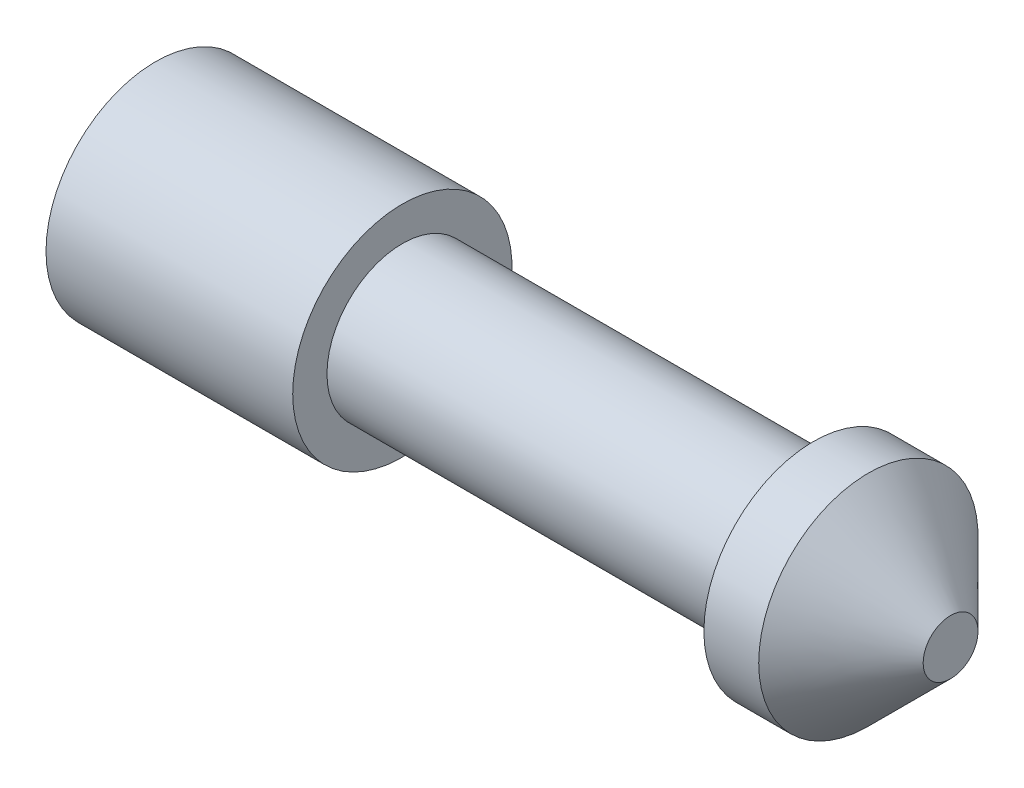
ISO-10303-21;
HEADER;
FILE_DESCRIPTION(('STEP AP214'),'2;1');
FILE_NAME('part.step','',(''),(''),'','','');
FILE_SCHEMA(('AUTOMOTIVE_DESIGN { 1 0 10303 214 1 1 1 1 }'));
ENDSEC;
DATA;
#1=APPLICATION_CONTEXT('core data for automotive mechanical design processes');
#2=APPLICATION_PROTOCOL_DEFINITION('international standard','automotive_design',2000,#1);
#3=PRODUCT_CONTEXT('',#1,'mechanical');
#4=PRODUCT('Part','Part','',(#3));
#5=PRODUCT_RELATED_PRODUCT_CATEGORY('part','',(#4));
#6=PRODUCT_DEFINITION_FORMATION('','',#4);
#7=PRODUCT_DEFINITION_CONTEXT('part definition',#1,'design');
#8=PRODUCT_DEFINITION('design','',#6,#7);
#9=PRODUCT_DEFINITION_SHAPE('','',#8);
#10=(LENGTH_UNIT() NAMED_UNIT(*) SI_UNIT(.MILLI.,.METRE.));
#11=(NAMED_UNIT(*) PLANE_ANGLE_UNIT() SI_UNIT($,.RADIAN.));
#12=(NAMED_UNIT(*) SI_UNIT($,.STERADIAN.) SOLID_ANGLE_UNIT());
#13=UNCERTAINTY_MEASURE_WITH_UNIT(LENGTH_MEASURE(1.E-05),#10,'distance_accuracy_value','');
#14=(GEOMETRIC_REPRESENTATION_CONTEXT(3) GLOBAL_UNCERTAINTY_ASSIGNED_CONTEXT((#13)) GLOBAL_UNIT_ASSIGNED_CONTEXT((#10,
#11,#12)) REPRESENTATION_CONTEXT('',''));
#15=CARTESIAN_POINT('',(0.,0.,0.));
#16=DIRECTION('',(0.,0.,1.));
#17=DIRECTION('',(1.,0.,0.));
#18=AXIS2_PLACEMENT_3D('',#15,#16,#17);
#19=CARTESIAN_POINT('',(0.,0.,0.));
#20=DIRECTION('',(-1.,0.,0.));
#21=DIRECTION('',(0.,0.,1.));
#22=AXIS2_PLACEMENT_3D('',#19,#20,#21);
#23=CYLINDRICAL_SURFACE('',#22,4.);
#24=CARTESIAN_POINT('',(0.,0.,0.));
#25=DIRECTION('',(-1.,0.,0.));
#26=DIRECTION('',(0.,0.,1.));
#27=AXIS2_PLACEMENT_3D('',#24,#25,#26);
#28=CIRCLE('',#27,4.);
#29=CARTESIAN_POINT('',(0.,0.,4.));
#30=VERTEX_POINT('',#29);
#31=EDGE_CURVE('E10',#30,#30,#28,.T.);
#32=ORIENTED_EDGE('',*,*,#31,.F.);
#33=EDGE_LOOP('',(#32));
#34=FACE_BOUND('',#33,.T.);
#35=CARTESIAN_POINT('',(9.,0.,0.));
#36=DIRECTION('',(-1.,0.,0.));
#37=DIRECTION('',(0.,0.,1.));
#38=AXIS2_PLACEMENT_3D('',#35,#36,#37);
#39=CIRCLE('',#38,4.);
#40=CARTESIAN_POINT('',(9.,0.,4.));
#41=VERTEX_POINT('',#40);
#42=EDGE_CURVE('E54',#41,#41,#39,.T.);
#43=ORIENTED_EDGE('',*,*,#42,.T.);
#44=EDGE_LOOP('',(#43));
#45=FACE_BOUND('',#44,.T.);
#46=ADVANCED_FACE('F29',(#34,#45),#23,.T.);
#47=CARTESIAN_POINT('',(0.,0.,-4.));
#48=DIRECTION('',(1.,0.,0.));
#49=DIRECTION('',(0.,0.,-1.));
#50=AXIS2_PLACEMENT_3D('',#47,#48,#49);
#51=PLANE('',#50);
#52=ORIENTED_EDGE('',*,*,#31,.T.);
#53=EDGE_LOOP('',(#52));
#54=FACE_BOUND('',#53,.T.);
#55=ADVANCED_FACE('F90',(#54),#51,.F.);
#56=CARTESIAN_POINT('',(29.,0.,0.));
#57=DIRECTION('',(-1.,0.,0.));
#58=DIRECTION('',(0.,0.,1.));
#59=AXIS2_PLACEMENT_3D('',#56,#57,#58);
#60=PLANE('',#59);
#61=CARTESIAN_POINT('',(29.,0.,0.));
#62=DIRECTION('',(-1.,0.,0.));
#63=DIRECTION('',(0.,0.,1.));
#64=AXIS2_PLACEMENT_3D('',#61,#62,#63);
#65=CIRCLE('',#64,1.00000000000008);
#66=CARTESIAN_POINT('',(29.,0.,1.00000000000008));
#67=VERTEX_POINT('',#66);
#68=EDGE_CURVE('E35',#67,#67,#65,.T.);
#69=ORIENTED_EDGE('',*,*,#68,.F.);
#70=EDGE_LOOP('',(#69));
#71=FACE_BOUND('',#70,.T.);
#72=ADVANCED_FACE('F85',(#71),#60,.F.);
#73=CARTESIAN_POINT('',(29.,0.,0.));
#74=DIRECTION('',(-1.,0.,0.));
#75=DIRECTION('',(0.,0.,1.));
#76=AXIS2_PLACEMENT_3D('',#73,#74,#75);
#77=CONICAL_SURFACE('',#76,1.00000000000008,0.785398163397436);
#78=CARTESIAN_POINT('',(26.,0.,0.));
#79=DIRECTION('',(-1.,0.,0.));
#80=DIRECTION('',(0.,0.,1.));
#81=AXIS2_PLACEMENT_3D('',#78,#79,#80);
#82=CIRCLE('',#81,4.);
#83=CARTESIAN_POINT('',(26.,0.,4.));
#84=VERTEX_POINT('',#83);
#85=EDGE_CURVE('E39',#84,#84,#82,.T.);
#86=CARTESIAN_POINT('',(26.,0.,4.));
#87=CARTESIAN_POINT('',(26.03125,0.,3.96875));
#88=CARTESIAN_POINT('',(26.0625,0.,3.9375));
#89=CARTESIAN_POINT('',(26.125,0.,3.875));
#90=CARTESIAN_POINT('',(26.15625,0.,3.84375));
#91=CARTESIAN_POINT('',(26.21875,0.,3.78125));
#92=CARTESIAN_POINT('',(26.25,0.,3.75));
#93=CARTESIAN_POINT('',(26.3125,0.,3.68750000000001));
#94=CARTESIAN_POINT('',(26.34375,0.,3.65625000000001));
#95=CARTESIAN_POINT('',(26.40625,0.,3.59375000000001));
#96=CARTESIAN_POINT('',(26.4375,0.,3.56250000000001));
#97=CARTESIAN_POINT('',(26.5,0.,3.50000000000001));
#98=CARTESIAN_POINT('',(26.53125,0.,3.46875000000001));
#99=CARTESIAN_POINT('',(26.59375,0.,3.40625000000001));
#100=CARTESIAN_POINT('',(26.625,0.,3.37500000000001));
#101=CARTESIAN_POINT('',(26.6875,0.,3.31250000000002));
#102=CARTESIAN_POINT('',(26.71875,0.,3.28125000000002));
#103=CARTESIAN_POINT('',(26.78125,0.,3.21875000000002));
#104=CARTESIAN_POINT('',(26.8125,0.,3.18750000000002));
#105=CARTESIAN_POINT('',(26.875,0.,3.12500000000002));
#106=CARTESIAN_POINT('',(26.90625,0.,3.09375000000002));
#107=CARTESIAN_POINT('',(26.96875,0.,3.03125000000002));
#108=CARTESIAN_POINT('',(27.,0.,3.00000000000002));
#109=CARTESIAN_POINT('',(27.0625,0.,2.93750000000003));
#110=CARTESIAN_POINT('',(27.09375,0.,2.90625000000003));
#111=CARTESIAN_POINT('',(27.15625,0.,2.84375000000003));
#112=CARTESIAN_POINT('',(27.1875,0.,2.81250000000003));
#113=CARTESIAN_POINT('',(27.25,0.,2.75000000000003));
#114=CARTESIAN_POINT('',(27.28125,0.,2.71875000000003));
#115=CARTESIAN_POINT('',(27.34375,0.,2.65625000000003));
#116=CARTESIAN_POINT('',(27.375,0.,2.62500000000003));
#117=CARTESIAN_POINT('',(27.4375,0.,2.56250000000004));
#118=CARTESIAN_POINT('',(27.46875,0.,2.53125000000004));
#119=CARTESIAN_POINT('',(27.53125,0.,2.46875000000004));
#120=CARTESIAN_POINT('',(27.5625,0.,2.43750000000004));
#121=CARTESIAN_POINT('',(27.625,0.,2.37500000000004));
#122=CARTESIAN_POINT('',(27.65625,0.,2.34375000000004));
#123=CARTESIAN_POINT('',(27.71875,0.,2.28125000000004));
#124=CARTESIAN_POINT('',(27.75,0.,2.25000000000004));
#125=CARTESIAN_POINT('',(27.8125,0.,2.18750000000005));
#126=CARTESIAN_POINT('',(27.84375,0.,2.15625000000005));
#127=CARTESIAN_POINT('',(27.90625,0.,2.09375000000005));
#128=CARTESIAN_POINT('',(27.9375,0.,2.06250000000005));
#129=CARTESIAN_POINT('',(28.,0.,2.00000000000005));
#130=CARTESIAN_POINT('',(28.03125,0.,1.96875000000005));
#131=CARTESIAN_POINT('',(28.09375,0.,1.90625000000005));
#132=CARTESIAN_POINT('',(28.125,0.,1.87500000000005));
#133=CARTESIAN_POINT('',(28.1875,0.,1.81250000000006));
#134=CARTESIAN_POINT('',(28.21875,0.,1.78125000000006));
#135=CARTESIAN_POINT('',(28.28125,0.,1.71875000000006));
#136=CARTESIAN_POINT('',(28.3125,0.,1.68750000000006));
#137=CARTESIAN_POINT('',(28.375,0.,1.62500000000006));
#138=CARTESIAN_POINT('',(28.40625,0.,1.59375000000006));
#139=CARTESIAN_POINT('',(28.46875,0.,1.53125000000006));
#140=CARTESIAN_POINT('',(28.5,0.,1.50000000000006));
#141=CARTESIAN_POINT('',(28.5625,0.,1.43750000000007));
#142=CARTESIAN_POINT('',(28.59375,0.,1.40625000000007));
#143=CARTESIAN_POINT('',(28.65625,0.,1.34375000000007));
#144=CARTESIAN_POINT('',(28.6875,0.,1.31250000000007));
#145=CARTESIAN_POINT('',(28.75,0.,1.25000000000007));
#146=CARTESIAN_POINT('',(28.78125,0.,1.21875000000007));
#147=CARTESIAN_POINT('',(28.84375,0.,1.15625000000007));
#148=CARTESIAN_POINT('',(28.875,0.,1.12500000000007));
#149=CARTESIAN_POINT('',(28.9375,0.,1.06250000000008));
#150=CARTESIAN_POINT('',(28.96875,0.,1.03125000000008));
#151=CARTESIAN_POINT('',(29.,0.,1.00000000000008));
#152=B_SPLINE_CURVE_WITH_KNOTS('',3,(#86,#87,#88,#89,#90,#91,#92,#93,#94,#95,#96,#97,#98,#99,
#100,#101,#102,#103,#104,#105,#106,#107,#108,#109,#110,#111,#112,#113,#114,#115,#116,#117,#118,
#119,#120,#121,#122,#123,#124,#125,#126,#127,#128,#129,#130,#131,#132,#133,#134,#135,#136,#137,
#138,#139,#140,#141,#142,#143,#144,#145,#146,#147,#148,#149,#150,#151),.UNSPECIFIED.,.F.,.F.,(4,
2,2,2,2,2,2,2,2,2,2,2,2,2,2,2,2,2,2,2,2,2,2,2,2,2,2,2,2,2,2,2,4),(0.,0.132582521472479,
0.265165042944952,0.397747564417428,0.530330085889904,0.66291260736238,0.795495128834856,
0.928077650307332,1.06066017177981,1.19324269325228,1.32582521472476,1.45840773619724,
1.59099025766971,1.72357277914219,1.85615530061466,1.98873782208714,2.12132034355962,
2.25390286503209,2.38648538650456,2.51906790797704,2.65165042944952,2.78423295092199,
2.91681547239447,3.04939799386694,3.18198051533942,3.3145630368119,3.44714555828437,
3.57972807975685,3.71231060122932,3.8448931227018,3.97747564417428,4.11005816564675,
4.24264068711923),.UNSPECIFIED.);
#153=EDGE_CURVE('BSEAM80',#84,#67,#152,.T.);
#154=ORIENTED_EDGE('',*,*,#85,.F.);
#155=ORIENTED_EDGE('',*,*,#68,.T.);
#156=ORIENTED_EDGE('',*,*,#153,.T.);
#157=ORIENTED_EDGE('',*,*,#153,.F.);
#158=EDGE_LOOP('',(#154,#156,#155,#157));
#159=FACE_BOUND('',#158,.T.);
#160=ADVANCED_FACE('F80',(#159),#77,.T.);
#161=CARTESIAN_POINT('',(0.,0.,0.));
#162=DIRECTION('',(-1.,0.,0.));
#163=DIRECTION('',(0.,0.,1.));
#164=AXIS2_PLACEMENT_3D('',#161,#162,#163);
#165=CYLINDRICAL_SURFACE('',#164,4.);
#166=CARTESIAN_POINT('',(24.,0.,0.));
#167=DIRECTION('',(-1.,0.,0.));
#168=DIRECTION('',(0.,0.,1.));
#169=AXIS2_PLACEMENT_3D('',#166,#167,#168);
#170=CIRCLE('',#169,4.);
#171=CARTESIAN_POINT('',(24.,0.,4.));
#172=VERTEX_POINT('',#171);
#173=EDGE_CURVE('E43',#172,#172,#170,.T.);
#174=ORIENTED_EDGE('',*,*,#173,.F.);
#175=EDGE_LOOP('',(#174));
#176=FACE_BOUND('',#175,.T.);
#177=ORIENTED_EDGE('',*,*,#85,.T.);
#178=EDGE_LOOP('',(#177));
#179=FACE_BOUND('',#178,.T.);
#180=ADVANCED_FACE('F74',(#176,#179),#165,.T.);
#181=CARTESIAN_POINT('',(24.,0.,-4.));
#182=DIRECTION('',(1.,0.,0.));
#183=DIRECTION('',(0.,0.,-1.));
#184=AXIS2_PLACEMENT_3D('',#181,#182,#183);
#185=PLANE('',#184);
#186=CARTESIAN_POINT('',(24.,0.,0.));
#187=DIRECTION('',(-1.,0.,0.));
#188=DIRECTION('',(0.,0.,1.));
#189=AXIS2_PLACEMENT_3D('',#186,#187,#188);
#190=CIRCLE('',#189,2.75);
#191=CARTESIAN_POINT('',(24.,0.,2.75));
#192=VERTEX_POINT('',#191);
#193=EDGE_CURVE('E48',#192,#192,#190,.T.);
#194=ORIENTED_EDGE('',*,*,#193,.F.);
#195=EDGE_LOOP('',(#194));
#196=FACE_BOUND('',#195,.T.);
#197=ORIENTED_EDGE('',*,*,#173,.T.);
#198=EDGE_LOOP('',(#197));
#199=FACE_BOUND('',#198,.T.);
#200=ADVANCED_FACE('F68',(#196,#199),#185,.F.);
#201=CARTESIAN_POINT('',(0.,0.,0.));
#202=DIRECTION('',(-1.,0.,0.));
#203=DIRECTION('',(0.,0.,1.));
#204=AXIS2_PLACEMENT_3D('',#201,#202,#203);
#205=CYLINDRICAL_SURFACE('',#204,2.75);
#206=CARTESIAN_POINT('',(9.00000000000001,0.,0.));
#207=DIRECTION('',(-1.,0.,0.));
#208=DIRECTION('',(0.,0.,1.));
#209=AXIS2_PLACEMENT_3D('',#206,#207,#208);
#210=CIRCLE('',#209,2.75);
#211=CARTESIAN_POINT('',(9.00000000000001,0.,2.75));
#212=VERTEX_POINT('',#211);
#213=EDGE_CURVE('E51',#212,#212,#210,.T.);
#214=ORIENTED_EDGE('',*,*,#213,.F.);
#215=EDGE_LOOP('',(#214));
#216=FACE_BOUND('',#215,.T.);
#217=ORIENTED_EDGE('',*,*,#193,.T.);
#218=EDGE_LOOP('',(#217));
#219=FACE_BOUND('',#218,.T.);
#220=ADVANCED_FACE('F62',(#216,#219),#205,.T.);
#221=CARTESIAN_POINT('',(9.,0.,-4.));
#222=DIRECTION('',(-1.,0.,0.));
#223=DIRECTION('',(0.,0.,1.));
#224=AXIS2_PLACEMENT_3D('',#221,#222,#223);
#225=PLANE('',#224);
#226=ORIENTED_EDGE('',*,*,#42,.F.);
#227=EDGE_LOOP('',(#226));
#228=FACE_BOUND('',#227,.T.);
#229=ORIENTED_EDGE('',*,*,#213,.T.);
#230=EDGE_LOOP('',(#229));
#231=FACE_BOUND('',#230,.T.);
#232=ADVANCED_FACE('F59',(#228,#231),#225,.F.);
#233=CLOSED_SHELL('',(#46,#55,#72,#160,#180,#200,#220,#232));
#234=MANIFOLD_SOLID_BREP('B2',#233);
#235=ADVANCED_BREP_SHAPE_REPRESENTATION('',(#18,#234),#14);
#236=SHAPE_DEFINITION_REPRESENTATION(#9,#235);
ENDSEC;
END-ISO-10303-21;
